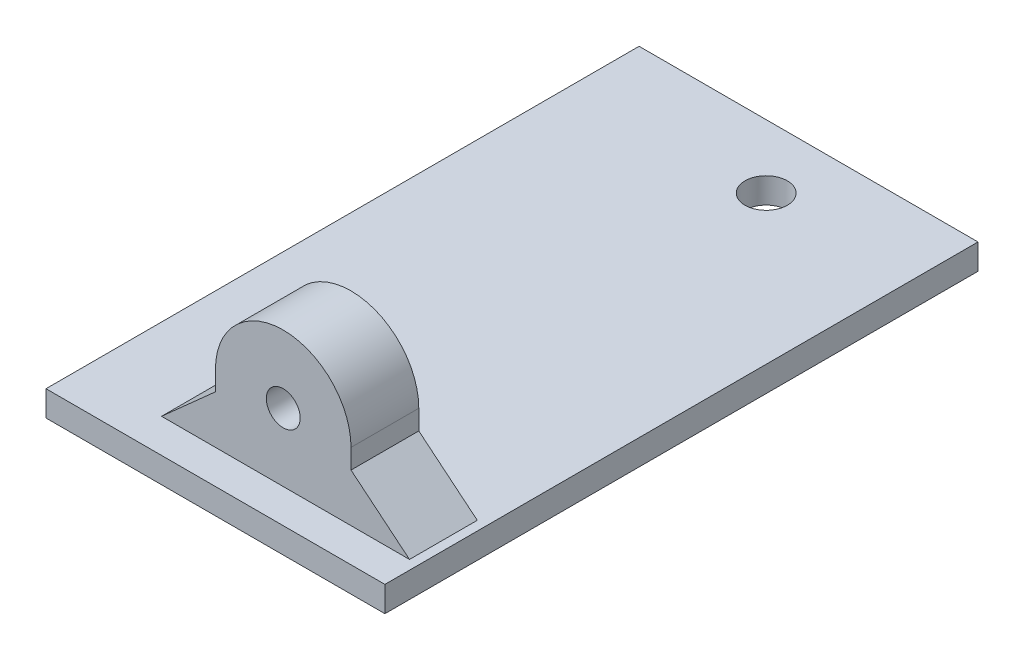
ISO-10303-21;
HEADER;
FILE_DESCRIPTION(('STEP AP214'),'2;1');
FILE_NAME('part.step','',(''),(''),'','','');
FILE_SCHEMA(('AUTOMOTIVE_DESIGN { 1 0 10303 214 1 1 1 1 }'));
ENDSEC;
DATA;
#1=APPLICATION_CONTEXT('core data for automotive mechanical design processes');
#2=APPLICATION_PROTOCOL_DEFINITION('international standard','automotive_design',2000,#1);
#3=PRODUCT_CONTEXT('',#1,'mechanical');
#4=PRODUCT('Part','Part','',(#3));
#5=PRODUCT_RELATED_PRODUCT_CATEGORY('part','',(#4));
#6=PRODUCT_DEFINITION_FORMATION('','',#4);
#7=PRODUCT_DEFINITION_CONTEXT('part definition',#1,'design');
#8=PRODUCT_DEFINITION('design','',#6,#7);
#9=PRODUCT_DEFINITION_SHAPE('','',#8);
#10=(LENGTH_UNIT() NAMED_UNIT(*) SI_UNIT(.MILLI.,.METRE.));
#11=(NAMED_UNIT(*) PLANE_ANGLE_UNIT() SI_UNIT($,.RADIAN.));
#12=(NAMED_UNIT(*) SI_UNIT($,.STERADIAN.) SOLID_ANGLE_UNIT());
#13=UNCERTAINTY_MEASURE_WITH_UNIT(LENGTH_MEASURE(1.E-05),#10,'distance_accuracy_value','');
#14=(GEOMETRIC_REPRESENTATION_CONTEXT(3) GLOBAL_UNCERTAINTY_ASSIGNED_CONTEXT((#13)) GLOBAL_UNIT_ASSIGNED_CONTEXT((#10,
#11,#12)) REPRESENTATION_CONTEXT('',''));
#15=CARTESIAN_POINT('',(0.,0.,0.));
#16=DIRECTION('',(0.,0.,1.));
#17=DIRECTION('',(1.,0.,0.));
#18=AXIS2_PLACEMENT_3D('',#15,#16,#17);
#19=CARTESIAN_POINT('',(32.,19.,28.));
#20=DIRECTION('',(1.,0.,0.));
#21=DIRECTION('',(0.,0.,-1.));
#22=AXIS2_PLACEMENT_3D('',#19,#20,#21);
#23=PLANE('',#22);
#24=DIRECTION('',(0.,-1.,0.));
#25=VECTOR('',#24,1.);
#26=CARTESIAN_POINT('',(32.,19.,36.));
#27=LINE('',#26,#25);
#28=CARTESIAN_POINT('',(32.,11.,36.));
#29=VERTEX_POINT('',#28);
#30=CARTESIAN_POINT('',(32.,8.68202751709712,36.));
#31=VERTEX_POINT('',#30);
#32=EDGE_CURVE('E186',#29,#31,#27,.T.);
#33=ORIENTED_EDGE('',*,*,#32,.T.);
#34=DIRECTION('',(0.,0.,1.));
#35=VECTOR('',#34,1.);
#36=CARTESIAN_POINT('',(32.,8.68202751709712,19.0606670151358));
#37=LINE('',#36,#35);
#38=CARTESIAN_POINT('',(32.,8.68202751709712,28.));
#39=VERTEX_POINT('',#38);
#40=EDGE_CURVE('E171',#39,#31,#37,.T.);
#41=ORIENTED_EDGE('',*,*,#40,.F.);
#42=DIRECTION('',(0.,-1.,0.));
#43=VECTOR('',#42,1.);
#44=CARTESIAN_POINT('',(32.,19.,28.));
#45=LINE('',#44,#43);
#46=CARTESIAN_POINT('',(32.,11.,28.));
#47=VERTEX_POINT('',#46);
#48=EDGE_CURVE('E194',#47,#39,#45,.T.);
#49=ORIENTED_EDGE('',*,*,#48,.F.);
#50=DIRECTION('',(0.,0.,1.));
#51=VECTOR('',#50,1.);
#52=CARTESIAN_POINT('',(32.,11.,20.));
#53=LINE('',#52,#51);
#54=EDGE_CURVE('E192',#47,#29,#53,.T.);
#55=ORIENTED_EDGE('',*,*,#54,.T.);
#56=EDGE_LOOP('',(#33,#41,#49,#55));
#57=FACE_BOUND('',#56,.T.);
#58=ADVANCED_FACE('F95',(#57),#23,.T.);
#59=CARTESIAN_POINT('',(0.,0.,0.));
#60=DIRECTION('',(1.,0.,0.));
#61=DIRECTION('',(0.,0.,-1.));
#62=AXIS2_PLACEMENT_3D('',#59,#60,#61);
#63=PLANE('',#62);
#64=DIRECTION('',(0.,1.,0.));
#65=VECTOR('',#64,1.);
#66=CARTESIAN_POINT('',(0.,3.,-30.));
#67=LINE('',#66,#65);
#68=CARTESIAN_POINT('',(0.,0.,-30.));
#69=VERTEX_POINT('',#68);
#70=CARTESIAN_POINT('',(0.,3.,-30.));
#71=VERTEX_POINT('',#70);
#72=EDGE_CURVE('E225',#69,#71,#67,.T.);
#73=ORIENTED_EDGE('',*,*,#72,.F.);
#74=DIRECTION('',(0.,0.,1.));
#75=VECTOR('',#74,1.);
#76=CARTESIAN_POINT('',(0.,0.,0.));
#77=LINE('',#76,#75);
#78=CARTESIAN_POINT('',(0.,0.,40.));
#79=VERTEX_POINT('',#78);
#80=EDGE_CURVE('E13',#69,#79,#77,.T.);
#81=ORIENTED_EDGE('',*,*,#80,.T.);
#82=DIRECTION('',(0.,-1.,0.));
#83=VECTOR('',#82,1.);
#84=CARTESIAN_POINT('',(0.,3.,40.));
#85=LINE('',#84,#83);
#86=CARTESIAN_POINT('',(0.,3.,40.));
#87=VERTEX_POINT('',#86);
#88=EDGE_CURVE('E250',#87,#79,#85,.T.);
#89=ORIENTED_EDGE('',*,*,#88,.F.);
#90=DIRECTION('',(0.,0.,1.));
#91=VECTOR('',#90,1.);
#92=CARTESIAN_POINT('',(0.,3.,0.));
#93=LINE('',#92,#91);
#94=EDGE_CURVE('E99',#71,#87,#93,.T.);
#95=ORIENTED_EDGE('',*,*,#94,.F.);
#96=EDGE_LOOP('',(#73,#81,#89,#95));
#97=FACE_BOUND('',#96,.T.);
#98=ADVANCED_FACE('F97',(#97),#63,.F.);
#99=CARTESIAN_POINT('',(16.,19.,36.));
#100=DIRECTION('',(0.,0.,-1.));
#101=DIRECTION('',(-1.,0.,0.));
#102=AXIS2_PLACEMENT_3D('',#99,#100,#101);
#103=PLANE('',#102);
#104=CARTESIAN_POINT('',(24.,11.,36.));
#105=DIRECTION('',(0.,0.,1.));
#106=DIRECTION('',(1.,0.,0.));
#107=AXIS2_PLACEMENT_3D('',#104,#105,#106);
#108=CIRCLE('',#107,2.);
#109=CARTESIAN_POINT('',(26.,11.,36.));
#110=VERTEX_POINT('',#109);
#111=EDGE_CURVE('E262',#110,#110,#108,.T.);
#112=ORIENTED_EDGE('',*,*,#111,.F.);
#113=EDGE_LOOP('',(#112));
#114=FACE_BOUND('',#113,.T.);
#115=CARTESIAN_POINT('',(24.,11.,36.));
#116=DIRECTION('',(0.,0.,1.));
#117=DIRECTION('',(1.,0.,0.));
#118=AXIS2_PLACEMENT_3D('',#115,#116,#117);
#119=CIRCLE('',#118,8.);
#120=CARTESIAN_POINT('',(16.,11.,36.));
#121=VERTEX_POINT('',#120);
#122=EDGE_CURVE('E232',#29,#121,#119,.T.);
#123=ORIENTED_EDGE('',*,*,#122,.T.);
#124=DIRECTION('',(0.,-1.,0.));
#125=VECTOR('',#124,1.);
#126=CARTESIAN_POINT('',(16.,19.,36.));
#127=LINE('',#126,#125);
#128=CARTESIAN_POINT('',(16.,8.68202751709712,36.));
#129=VERTEX_POINT('',#128);
#130=EDGE_CURVE('E193',#121,#129,#127,.T.);
#131=ORIENTED_EDGE('',*,*,#130,.T.);
#132=DIRECTION('',(-0.745837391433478,-0.666128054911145,0.));
#133=VECTOR('',#132,1.);
#134=CARTESIAN_POINT('',(2.7861925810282,-3.11959028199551,36.));
#135=LINE('',#134,#133);
#136=CARTESIAN_POINT('',(9.63805720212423,3.,36.));
#137=VERTEX_POINT('',#136);
#138=EDGE_CURVE('E181',#129,#137,#135,.T.);
#139=ORIENTED_EDGE('',*,*,#138,.T.);
#140=DIRECTION('',(1.,0.,0.));
#141=VECTOR('',#140,1.);
#142=CARTESIAN_POINT('',(16.,3.,36.));
#143=LINE('',#142,#141);
#144=CARTESIAN_POINT('',(38.9011765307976,3.,36.));
#145=VERTEX_POINT('',#144);
#146=EDGE_CURVE('E188',#137,#145,#143,.T.);
#147=ORIENTED_EDGE('',*,*,#146,.T.);
#148=DIRECTION('',(0.772001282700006,-0.635620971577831,0.));
#149=VECTOR('',#148,1.);
#150=CARTESIAN_POINT('',(32.,8.68202751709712,36.));
#151=LINE('',#150,#149);
#152=EDGE_CURVE('E175',#31,#145,#151,.T.);
#153=ORIENTED_EDGE('',*,*,#152,.F.);
#154=ORIENTED_EDGE('',*,*,#32,.F.);
#155=EDGE_LOOP('',(#123,#131,#139,#147,#153,#154));
#156=FACE_BOUND('',#155,.T.);
#157=ADVANCED_FACE('F185',(#114,#156),#103,.F.);
#158=CARTESIAN_POINT('',(16.,19.,28.));
#159=DIRECTION('',(0.,0.,-1.));
#160=DIRECTION('',(-1.,0.,0.));
#161=AXIS2_PLACEMENT_3D('',#158,#159,#160);
#162=PLANE('',#161);
#163=CARTESIAN_POINT('',(24.,11.,28.));
#164=DIRECTION('',(0.,0.,-1.));
#165=DIRECTION('',(-1.,0.,0.));
#166=AXIS2_PLACEMENT_3D('',#163,#164,#165);
#167=CIRCLE('',#166,2.);
#168=CARTESIAN_POINT('',(22.,11.,28.));
#169=VERTEX_POINT('',#168);
#170=EDGE_CURVE('E230',#169,#169,#167,.T.);
#171=ORIENTED_EDGE('',*,*,#170,.F.);
#172=EDGE_LOOP('',(#171));
#173=FACE_BOUND('',#172,.T.);
#174=DIRECTION('',(0.,-1.,0.));
#175=VECTOR('',#174,1.);
#176=CARTESIAN_POINT('',(16.,19.,28.));
#177=LINE('',#176,#175);
#178=CARTESIAN_POINT('',(16.,11.,28.));
#179=VERTEX_POINT('',#178);
#180=CARTESIAN_POINT('',(16.,8.68202751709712,28.));
#181=VERTEX_POINT('',#180);
#182=EDGE_CURVE('E199',#179,#181,#177,.T.);
#183=ORIENTED_EDGE('',*,*,#182,.F.);
#184=CARTESIAN_POINT('',(24.,11.,28.));
#185=DIRECTION('',(0.,0.,-1.));
#186=DIRECTION('',(-1.,0.,0.));
#187=AXIS2_PLACEMENT_3D('',#184,#185,#186);
#188=CIRCLE('',#187,8.);
#189=EDGE_CURVE('E269',#179,#47,#188,.T.);
#190=ORIENTED_EDGE('',*,*,#189,.T.);
#191=ORIENTED_EDGE('',*,*,#48,.T.);
#192=DIRECTION('',(0.772001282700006,-0.635620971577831,0.));
#193=VECTOR('',#192,1.);
#194=CARTESIAN_POINT('',(32.,8.68202751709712,28.));
#195=LINE('',#194,#193);
#196=CARTESIAN_POINT('',(38.9011765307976,3.,28.));
#197=VERTEX_POINT('',#196);
#198=EDGE_CURVE('E176',#39,#197,#195,.T.);
#199=ORIENTED_EDGE('',*,*,#198,.T.);
#200=DIRECTION('',(1.,0.,0.));
#201=VECTOR('',#200,1.);
#202=CARTESIAN_POINT('',(16.,3.,28.));
#203=LINE('',#202,#201);
#204=CARTESIAN_POINT('',(9.63805720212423,3.,28.));
#205=VERTEX_POINT('',#204);
#206=EDGE_CURVE('E111',#205,#197,#203,.T.);
#207=ORIENTED_EDGE('',*,*,#206,.F.);
#208=DIRECTION('',(-0.745837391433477,-0.666128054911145,0.));
#209=VECTOR('',#208,1.);
#210=CARTESIAN_POINT('',(2.7861925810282,-3.11959028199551,28.));
#211=LINE('',#210,#209);
#212=EDGE_CURVE('E283',#181,#205,#211,.T.);
#213=ORIENTED_EDGE('',*,*,#212,.F.);
#214=EDGE_LOOP('',(#183,#190,#191,#199,#207,#213));
#215=FACE_BOUND('',#214,.T.);
#216=ADVANCED_FACE('F282',(#173,#215),#162,.T.);
#217=CARTESIAN_POINT('',(16.,19.,28.));
#218=DIRECTION('',(1.,0.,0.));
#219=DIRECTION('',(0.,0.,-1.));
#220=AXIS2_PLACEMENT_3D('',#217,#218,#219);
#221=PLANE('',#220);
#222=ORIENTED_EDGE('',*,*,#182,.T.);
#223=DIRECTION('',(0.,0.,1.));
#224=VECTOR('',#223,1.);
#225=CARTESIAN_POINT('',(16.,8.68202751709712,19.0606670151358));
#226=LINE('',#225,#224);
#227=EDGE_CURVE('E281',#181,#129,#226,.T.);
#228=ORIENTED_EDGE('',*,*,#227,.T.);
#229=ORIENTED_EDGE('',*,*,#130,.F.);
#230=DIRECTION('',(0.,0.,1.));
#231=VECTOR('',#230,1.);
#232=CARTESIAN_POINT('',(16.,11.,20.));
#233=LINE('',#232,#231);
#234=EDGE_CURVE('E233',#179,#121,#233,.T.);
#235=ORIENTED_EDGE('',*,*,#234,.F.);
#236=EDGE_LOOP('',(#222,#228,#229,#235));
#237=FACE_BOUND('',#236,.T.);
#238=ADVANCED_FACE('F278',(#237),#221,.F.);
#239=CARTESIAN_POINT('',(0.,3.,0.));
#240=DIRECTION('',(0.,-1.,0.));
#241=DIRECTION('',(0.,0.,-1.));
#242=AXIS2_PLACEMENT_3D('',#239,#240,#241);
#243=PLANE('',#242);
#244=DIRECTION('',(-1.,0.,0.));
#245=VECTOR('',#244,1.);
#246=CARTESIAN_POINT('',(32.,3.,40.));
#247=LINE('',#246,#245);
#248=CARTESIAN_POINT('',(40.,3.,40.));
#249=VERTEX_POINT('',#248);
#250=EDGE_CURVE('E242',#249,#87,#247,.T.);
#251=ORIENTED_EDGE('',*,*,#250,.F.);
#252=DIRECTION('',(0.,0.,-1.));
#253=VECTOR('',#252,1.);
#254=CARTESIAN_POINT('',(40.,3.,30.));
#255=LINE('',#254,#253);
#256=CARTESIAN_POINT('',(40.,3.,-30.));
#257=VERTEX_POINT('',#256);
#258=EDGE_CURVE('E209',#249,#257,#255,.T.);
#259=ORIENTED_EDGE('',*,*,#258,.T.);
#260=DIRECTION('',(-1.,0.,0.));
#261=VECTOR('',#260,1.);
#262=CARTESIAN_POINT('',(-40.,3.,-30.));
#263=LINE('',#262,#261);
#264=EDGE_CURVE('E212',#257,#71,#263,.T.);
#265=ORIENTED_EDGE('',*,*,#264,.T.);
#266=ORIENTED_EDGE('',*,*,#94,.T.);
#267=EDGE_LOOP('',(#251,#259,#265,#266));
#268=FACE_BOUND('',#267,.T.);
#269=CARTESIAN_POINT('',(22.5,3.,22.5));
#270=DIRECTION('',(0.,1.,0.));
#271=DIRECTION('',(0.,0.,1.));
#272=AXIS2_PLACEMENT_3D('',#269,#270,#271);
#273=CIRCLE('',#272,2.5);
#274=CARTESIAN_POINT('',(22.5,3.,25.));
#275=VERTEX_POINT('',#274);
#276=EDGE_CURVE('E197',#275,#275,#273,.T.);
#277=ORIENTED_EDGE('',*,*,#276,.F.);
#278=EDGE_LOOP('',(#277));
#279=FACE_BOUND('',#278,.T.);
#280=CARTESIAN_POINT('',(22.5,3.,-22.5));
#281=DIRECTION('',(0.,1.,0.));
#282=DIRECTION('',(0.,0.,1.));
#283=AXIS2_PLACEMENT_3D('',#280,#281,#282);
#284=CIRCLE('',#283,2.5);
#285=CARTESIAN_POINT('',(22.5,3.,-20.));
#286=VERTEX_POINT('',#285);
#287=EDGE_CURVE('E203',#286,#286,#284,.T.);
#288=ORIENTED_EDGE('',*,*,#287,.F.);
#289=EDGE_LOOP('',(#288));
#290=FACE_BOUND('',#289,.T.);
#291=DIRECTION('',(0.,0.,1.));
#292=VECTOR('',#291,1.);
#293=CARTESIAN_POINT('',(38.9011765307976,3.,19.0606670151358));
#294=LINE('',#293,#292);
#295=EDGE_CURVE('E189',#197,#145,#294,.T.);
#296=ORIENTED_EDGE('',*,*,#295,.T.);
#297=ORIENTED_EDGE('',*,*,#146,.F.);
#298=DIRECTION('',(0.,0.,1.));
#299=VECTOR('',#298,1.);
#300=CARTESIAN_POINT('',(9.63805720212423,3.,19.0606670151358));
#301=LINE('',#300,#299);
#302=EDGE_CURVE('E254',#205,#137,#301,.T.);
#303=ORIENTED_EDGE('',*,*,#302,.F.);
#304=ORIENTED_EDGE('',*,*,#206,.T.);
#305=EDGE_LOOP('',(#296,#297,#303,#304));
#306=FACE_BOUND('',#305,.T.);
#307=ADVANCED_FACE('F240',(#268,#279,#290,#306),#243,.F.);
#308=CARTESIAN_POINT('',(40.,3.,30.));
#309=DIRECTION('',(-1.,0.,0.));
#310=DIRECTION('',(0.,0.,1.));
#311=AXIS2_PLACEMENT_3D('',#308,#309,#310);
#312=PLANE('',#311);
#313=DIRECTION('',(0.,0.,-1.));
#314=VECTOR('',#313,1.);
#315=CARTESIAN_POINT('',(40.,0.,30.));
#316=LINE('',#315,#314);
#317=CARTESIAN_POINT('',(40.,0.,40.));
#318=VERTEX_POINT('',#317);
#319=CARTESIAN_POINT('',(40.,0.,-30.));
#320=VERTEX_POINT('',#319);
#321=EDGE_CURVE('E217',#318,#320,#316,.T.);
#322=ORIENTED_EDGE('',*,*,#321,.T.);
#323=DIRECTION('',(0.,-1.,0.));
#324=VECTOR('',#323,1.);
#325=CARTESIAN_POINT('',(40.,3.,-30.));
#326=LINE('',#325,#324);
#327=EDGE_CURVE('E216',#257,#320,#326,.T.);
#328=ORIENTED_EDGE('',*,*,#327,.F.);
#329=ORIENTED_EDGE('',*,*,#258,.F.);
#330=DIRECTION('',(0.,1.,0.));
#331=VECTOR('',#330,1.);
#332=CARTESIAN_POINT('',(40.,0.,40.));
#333=LINE('',#332,#331);
#334=EDGE_CURVE('E253',#318,#249,#333,.T.);
#335=ORIENTED_EDGE('',*,*,#334,.F.);
#336=EDGE_LOOP('',(#322,#328,#329,#335));
#337=FACE_BOUND('',#336,.T.);
#338=ADVANCED_FACE('F323',(#337),#312,.F.);
#339=CARTESIAN_POINT('',(-40.,3.,-30.));
#340=DIRECTION('',(0.,0.,1.));
#341=DIRECTION('',(1.,0.,0.));
#342=AXIS2_PLACEMENT_3D('',#339,#340,#341);
#343=PLANE('',#342);
#344=DIRECTION('',(-1.,0.,0.));
#345=VECTOR('',#344,1.);
#346=CARTESIAN_POINT('',(-40.,0.,-30.));
#347=LINE('',#346,#345);
#348=EDGE_CURVE('E213',#320,#69,#347,.T.);
#349=ORIENTED_EDGE('',*,*,#348,.T.);
#350=ORIENTED_EDGE('',*,*,#72,.T.);
#351=ORIENTED_EDGE('',*,*,#264,.F.);
#352=ORIENTED_EDGE('',*,*,#327,.T.);
#353=EDGE_LOOP('',(#349,#350,#351,#352));
#354=FACE_BOUND('',#353,.T.);
#355=ADVANCED_FACE('F326',(#354),#343,.F.);
#356=CARTESIAN_POINT('',(0.,0.,0.));
#357=DIRECTION('',(0.,-1.,0.));
#358=DIRECTION('',(0.,0.,-1.));
#359=AXIS2_PLACEMENT_3D('',#356,#357,#358);
#360=PLANE('',#359);
#361=ORIENTED_EDGE('',*,*,#80,.F.);
#362=ORIENTED_EDGE('',*,*,#348,.F.);
#363=ORIENTED_EDGE('',*,*,#321,.F.);
#364=DIRECTION('',(1.,0.,0.));
#365=VECTOR('',#364,1.);
#366=CARTESIAN_POINT('',(0.,0.,40.));
#367=LINE('',#366,#365);
#368=EDGE_CURVE('E256',#79,#318,#367,.T.);
#369=ORIENTED_EDGE('',*,*,#368,.F.);
#370=EDGE_LOOP('',(#361,#362,#363,#369));
#371=FACE_BOUND('',#370,.T.);
#372=CARTESIAN_POINT('',(22.5,0.,22.5));
#373=DIRECTION('',(0.,-1.,0.));
#374=DIRECTION('',(0.,0.,-1.));
#375=AXIS2_PLACEMENT_3D('',#372,#373,#374);
#376=CIRCLE('',#375,2.5);
#377=CARTESIAN_POINT('',(22.5,0.,20.));
#378=VERTEX_POINT('',#377);
#379=EDGE_CURVE('E220',#378,#378,#376,.T.);
#380=ORIENTED_EDGE('',*,*,#379,.F.);
#381=EDGE_LOOP('',(#380));
#382=FACE_BOUND('',#381,.T.);
#383=CARTESIAN_POINT('',(22.5,0.,-22.5));
#384=DIRECTION('',(0.,-1.,0.));
#385=DIRECTION('',(0.,0.,-1.));
#386=AXIS2_PLACEMENT_3D('',#383,#384,#385);
#387=CIRCLE('',#386,2.5);
#388=CARTESIAN_POINT('',(22.5,0.,-25.));
#389=VERTEX_POINT('',#388);
#390=EDGE_CURVE('E206',#389,#389,#387,.T.);
#391=ORIENTED_EDGE('',*,*,#390,.F.);
#392=EDGE_LOOP('',(#391));
#393=FACE_BOUND('',#392,.T.);
#394=ADVANCED_FACE('F318',(#371,#382,#393),#360,.T.);
#395=CARTESIAN_POINT('',(22.5,-7.,-22.5));
#396=DIRECTION('',(0.,1.,0.));
#397=DIRECTION('',(0.,0.,1.));
#398=AXIS2_PLACEMENT_3D('',#395,#396,#397);
#399=CYLINDRICAL_SURFACE('',#398,2.5);
#400=ORIENTED_EDGE('',*,*,#390,.T.);
#401=EDGE_LOOP('',(#400));
#402=FACE_BOUND('',#401,.T.);
#403=ORIENTED_EDGE('',*,*,#287,.T.);
#404=EDGE_LOOP('',(#403));
#405=FACE_BOUND('',#404,.T.);
#406=ADVANCED_FACE('F302',(#402,#405),#399,.F.);
#407=CARTESIAN_POINT('',(22.5,-7.,22.5));
#408=DIRECTION('',(0.,1.,0.));
#409=DIRECTION('',(0.,0.,1.));
#410=AXIS2_PLACEMENT_3D('',#407,#408,#409);
#411=CYLINDRICAL_SURFACE('',#410,2.5);
#412=ORIENTED_EDGE('',*,*,#379,.T.);
#413=EDGE_LOOP('',(#412));
#414=FACE_BOUND('',#413,.T.);
#415=ORIENTED_EDGE('',*,*,#276,.T.);
#416=EDGE_LOOP('',(#415));
#417=FACE_BOUND('',#416,.T.);
#418=ADVANCED_FACE('F294',(#414,#417),#411,.F.);
#419=CARTESIAN_POINT('',(24.,11.,20.));
#420=DIRECTION('',(0.,0.,1.));
#421=DIRECTION('',(1.,0.,0.));
#422=AXIS2_PLACEMENT_3D('',#419,#420,#421);
#423=CYLINDRICAL_SURFACE('',#422,8.);
#424=ORIENTED_EDGE('',*,*,#189,.F.);
#425=ORIENTED_EDGE('',*,*,#234,.T.);
#426=ORIENTED_EDGE('',*,*,#122,.F.);
#427=ORIENTED_EDGE('',*,*,#54,.F.);
#428=EDGE_LOOP('',(#424,#425,#426,#427));
#429=FACE_BOUND('',#428,.T.);
#430=ADVANCED_FACE('F291',(#429),#423,.T.);
#431=CARTESIAN_POINT('',(24.,11.,20.));
#432=DIRECTION('',(0.,0.,1.));
#433=DIRECTION('',(1.,0.,0.));
#434=AXIS2_PLACEMENT_3D('',#431,#432,#433);
#435=CYLINDRICAL_SURFACE('',#434,2.);
#436=ORIENTED_EDGE('',*,*,#170,.T.);
#437=EDGE_LOOP('',(#436));
#438=FACE_BOUND('',#437,.T.);
#439=ORIENTED_EDGE('',*,*,#111,.T.);
#440=EDGE_LOOP('',(#439));
#441=FACE_BOUND('',#440,.T.);
#442=ADVANCED_FACE('F293',(#438,#441),#435,.F.);
#443=CARTESIAN_POINT('',(0.,0.,40.));
#444=DIRECTION('',(0.,0.,1.));
#445=DIRECTION('',(1.,0.,0.));
#446=AXIS2_PLACEMENT_3D('',#443,#444,#445);
#447=PLANE('',#446);
#448=ORIENTED_EDGE('',*,*,#250,.T.);
#449=ORIENTED_EDGE('',*,*,#88,.T.);
#450=ORIENTED_EDGE('',*,*,#368,.T.);
#451=ORIENTED_EDGE('',*,*,#334,.T.);
#452=EDGE_LOOP('',(#448,#449,#450,#451));
#453=FACE_BOUND('',#452,.T.);
#454=ADVANCED_FACE('F248',(#453),#447,.T.);
#455=CARTESIAN_POINT('',(2.7861925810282,-3.11959028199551,19.0606670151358));
#456=DIRECTION('',(-0.666128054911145,0.745837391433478,0.));
#457=DIRECTION('',(-0.745837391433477,-0.666128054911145,0.));
#458=AXIS2_PLACEMENT_3D('',#455,#456,#457);
#459=PLANE('',#458);
#460=ORIENTED_EDGE('',*,*,#227,.F.);
#461=ORIENTED_EDGE('',*,*,#212,.T.);
#462=ORIENTED_EDGE('',*,*,#302,.T.);
#463=ORIENTED_EDGE('',*,*,#138,.F.);
#464=EDGE_LOOP('',(#460,#461,#462,#463));
#465=FACE_BOUND('',#464,.T.);
#466=ADVANCED_FACE('F287',(#465),#459,.T.);
#467=CARTESIAN_POINT('',(32.,8.68202751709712,19.0606670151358));
#468=DIRECTION('',(-0.635620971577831,-0.772001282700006,0.));
#469=DIRECTION('',(0.772001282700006,-0.635620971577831,0.));
#470=AXIS2_PLACEMENT_3D('',#467,#468,#469);
#471=PLANE('',#470);
#472=ORIENTED_EDGE('',*,*,#198,.F.);
#473=ORIENTED_EDGE('',*,*,#40,.T.);
#474=ORIENTED_EDGE('',*,*,#152,.T.);
#475=ORIENTED_EDGE('',*,*,#295,.F.);
#476=EDGE_LOOP('',(#472,#473,#474,#475));
#477=FACE_BOUND('',#476,.T.);
#478=ADVANCED_FACE('F173',(#477),#471,.F.);
#479=CLOSED_SHELL('',(#58,#98,#157,#216,#238,#307,#338,#355,#394,#406,#418,#430,#442,#454,#466,#478));
#480=MANIFOLD_SOLID_BREP('B2',#479);
#481=ADVANCED_BREP_SHAPE_REPRESENTATION('',(#18,#480),#14);
#482=SHAPE_DEFINITION_REPRESENTATION(#9,#481);
ENDSEC;
END-ISO-10303-21;
